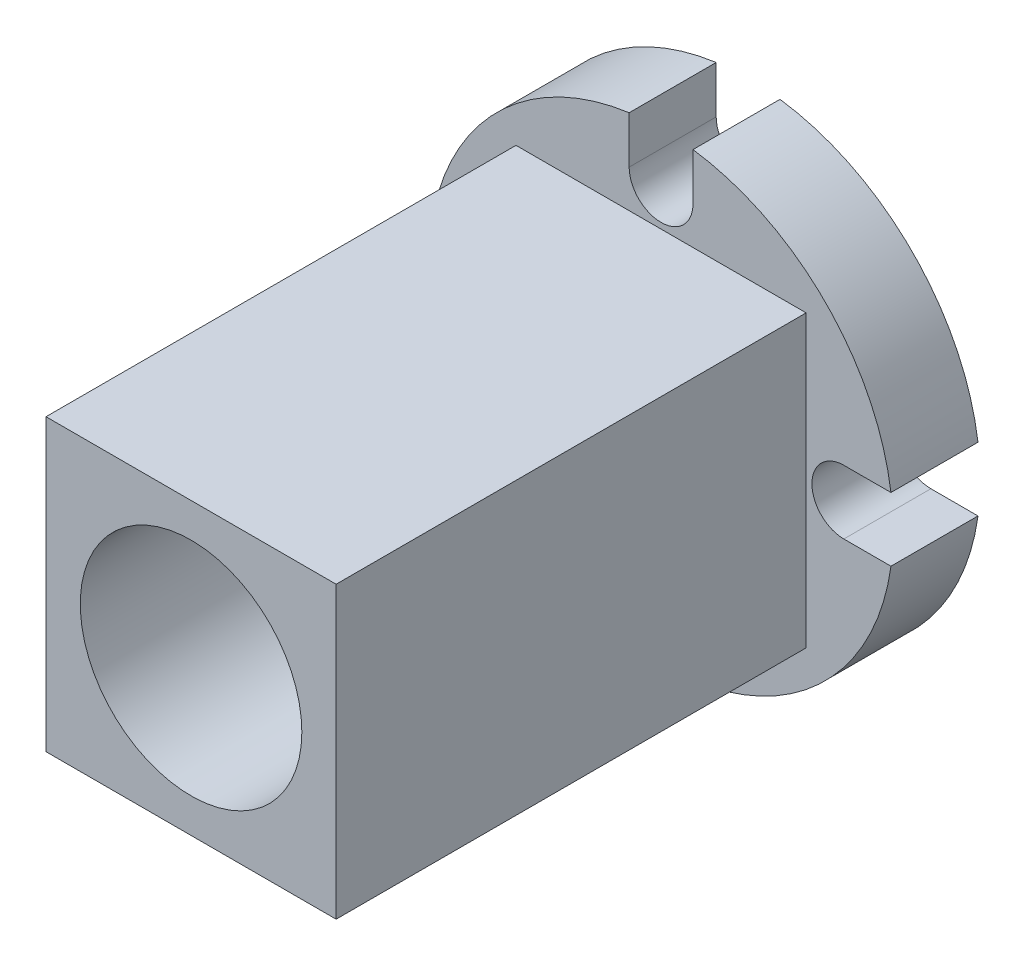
ISO-10303-21;
HEADER;
FILE_DESCRIPTION(('STEP AP214'),'2;1');
FILE_NAME('part.step','',(''),(''),'','','');
FILE_SCHEMA(('AUTOMOTIVE_DESIGN { 1 0 10303 214 1 1 1 1 }'));
ENDSEC;
DATA;
#1=APPLICATION_CONTEXT('core data for automotive mechanical design processes');
#2=APPLICATION_PROTOCOL_DEFINITION('international standard','automotive_design',2000,#1);
#3=PRODUCT_CONTEXT('',#1,'mechanical');
#4=PRODUCT('Part','Part','',(#3));
#5=PRODUCT_RELATED_PRODUCT_CATEGORY('part','',(#4));
#6=PRODUCT_DEFINITION_FORMATION('','',#4);
#7=PRODUCT_DEFINITION_CONTEXT('part definition',#1,'design');
#8=PRODUCT_DEFINITION('design','',#6,#7);
#9=PRODUCT_DEFINITION_SHAPE('','',#8);
#10=(LENGTH_UNIT() NAMED_UNIT(*) SI_UNIT(.MILLI.,.METRE.));
#11=(NAMED_UNIT(*) PLANE_ANGLE_UNIT() SI_UNIT($,.RADIAN.));
#12=(NAMED_UNIT(*) SI_UNIT($,.STERADIAN.) SOLID_ANGLE_UNIT());
#13=UNCERTAINTY_MEASURE_WITH_UNIT(LENGTH_MEASURE(1.E-05),#10,'distance_accuracy_value','');
#14=(GEOMETRIC_REPRESENTATION_CONTEXT(3) GLOBAL_UNCERTAINTY_ASSIGNED_CONTEXT((#13)) GLOBAL_UNIT_ASSIGNED_CONTEXT((#10,
#11,#12)) REPRESENTATION_CONTEXT('',''));
#15=CARTESIAN_POINT('',(0.,0.,0.));
#16=DIRECTION('',(0.,0.,1.));
#17=DIRECTION('',(1.,0.,0.));
#18=AXIS2_PLACEMENT_3D('',#15,#16,#17);
#19=CARTESIAN_POINT('',(-25.,-25.,96.));
#20=DIRECTION('',(0.,0.,1.));
#21=DIRECTION('',(1.,0.,0.));
#22=AXIS2_PLACEMENT_3D('',#19,#20,#21);
#23=PLANE('',#22);
#24=CARTESIAN_POINT('',(0.,0.,96.));
#25=DIRECTION('',(0.,0.,1.));
#26=DIRECTION('',(1.,0.,0.));
#27=AXIS2_PLACEMENT_3D('',#24,#25,#26);
#28=CIRCLE('',#27,19.0918830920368);
#29=CARTESIAN_POINT('',(19.0918830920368,0.,96.));
#30=VERTEX_POINT('',#29);
#31=EDGE_CURVE('E411',#30,#30,#28,.T.);
#32=ORIENTED_EDGE('',*,*,#31,.F.);
#33=EDGE_LOOP('',(#32));
#34=FACE_BOUND('',#33,.T.);
#35=DIRECTION('',(0.,-1.,0.));
#36=VECTOR('',#35,1.);
#37=CARTESIAN_POINT('',(-25.,25.,96.));
#38=LINE('',#37,#36);
#39=CARTESIAN_POINT('',(-25.,25.,96.));
#40=VERTEX_POINT('',#39);
#41=CARTESIAN_POINT('',(-25.,-25.,96.));
#42=VERTEX_POINT('',#41);
#43=EDGE_CURVE('E402',#40,#42,#38,.T.);
#44=ORIENTED_EDGE('',*,*,#43,.T.);
#45=DIRECTION('',(1.,0.,0.));
#46=VECTOR('',#45,1.);
#47=CARTESIAN_POINT('',(-25.,-25.,96.));
#48=LINE('',#47,#46);
#49=CARTESIAN_POINT('',(25.,-25.,96.));
#50=VERTEX_POINT('',#49);
#51=EDGE_CURVE('E417',#42,#50,#48,.T.);
#52=ORIENTED_EDGE('',*,*,#51,.T.);
#53=DIRECTION('',(0.,1.,0.));
#54=VECTOR('',#53,1.);
#55=CARTESIAN_POINT('',(25.,25.,96.));
#56=LINE('',#55,#54);
#57=CARTESIAN_POINT('',(25.,25.,96.));
#58=VERTEX_POINT('',#57);
#59=EDGE_CURVE('E414',#50,#58,#56,.T.);
#60=ORIENTED_EDGE('',*,*,#59,.T.);
#61=DIRECTION('',(-1.,0.,0.));
#62=VECTOR('',#61,1.);
#63=CARTESIAN_POINT('',(-25.,25.,96.));
#64=LINE('',#63,#62);
#65=EDGE_CURVE('E399',#58,#40,#64,.T.);
#66=ORIENTED_EDGE('',*,*,#65,.T.);
#67=EDGE_LOOP('',(#44,#52,#60,#66));
#68=FACE_BOUND('',#67,.T.);
#69=ADVANCED_FACE('F14',(#34,#68),#23,.T.);
#70=CARTESIAN_POINT('',(0.,0.,15.));
#71=DIRECTION('',(0.,0.,1.));
#72=DIRECTION('',(1.,0.,0.));
#73=AXIS2_PLACEMENT_3D('',#70,#71,#72);
#74=PLANE('',#73);
#75=CARTESIAN_POINT('',(0.,0.,15.));
#76=DIRECTION('',(0.,0.,1.));
#77=DIRECTION('',(1.,0.,0.));
#78=AXIS2_PLACEMENT_3D('',#75,#76,#77);
#79=CIRCLE('',#78,40.);
#80=CARTESIAN_POINT('',(-5.5,39.6200706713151,15.));
#81=VERTEX_POINT('',#80);
#82=CARTESIAN_POINT('',(-39.6200706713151,5.5,15.));
#83=VERTEX_POINT('',#82);
#84=EDGE_CURVE('E205',#81,#83,#79,.T.);
#85=ORIENTED_EDGE('',*,*,#84,.T.);
#86=DIRECTION('',(1.,0.,0.));
#87=VECTOR('',#86,1.);
#88=CARTESIAN_POINT('',(-39.6200706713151,5.5,15.));
#89=LINE('',#88,#87);
#90=CARTESIAN_POINT('',(-31.5,5.5,15.));
#91=VERTEX_POINT('',#90);
#92=EDGE_CURVE('E104',#83,#91,#89,.T.);
#93=ORIENTED_EDGE('',*,*,#92,.T.);
#94=CARTESIAN_POINT('',(-31.5,0.,15.));
#95=DIRECTION('',(0.,0.,-1.));
#96=DIRECTION('',(1.,0.,0.));
#97=AXIS2_PLACEMENT_3D('',#94,#95,#96);
#98=CIRCLE('',#97,5.5);
#99=CARTESIAN_POINT('',(-31.5,-5.5,15.));
#100=VERTEX_POINT('',#99);
#101=EDGE_CURVE('E360',#91,#100,#98,.T.);
#102=ORIENTED_EDGE('',*,*,#101,.T.);
#103=DIRECTION('',(-1.,0.,0.));
#104=VECTOR('',#103,1.);
#105=CARTESIAN_POINT('',(-39.6200706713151,-5.5,15.));
#106=LINE('',#105,#104);
#107=CARTESIAN_POINT('',(-39.6200706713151,-5.5,15.));
#108=VERTEX_POINT('',#107);
#109=EDGE_CURVE('E362',#100,#108,#106,.T.);
#110=ORIENTED_EDGE('',*,*,#109,.T.);
#111=CARTESIAN_POINT('',(0.,0.,15.));
#112=DIRECTION('',(0.,0.,1.));
#113=DIRECTION('',(1.,0.,0.));
#114=AXIS2_PLACEMENT_3D('',#111,#112,#113);
#115=CIRCLE('',#114,40.);
#116=CARTESIAN_POINT('',(-5.5,-39.6200706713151,15.));
#117=VERTEX_POINT('',#116);
#118=EDGE_CURVE('E364',#108,#117,#115,.T.);
#119=ORIENTED_EDGE('',*,*,#118,.T.);
#120=DIRECTION('',(0.,1.,0.));
#121=VECTOR('',#120,1.);
#122=CARTESIAN_POINT('',(-5.5,-39.6200706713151,15.));
#123=LINE('',#122,#121);
#124=CARTESIAN_POINT('',(-5.5,-31.5,15.));
#125=VERTEX_POINT('',#124);
#126=EDGE_CURVE('E370',#117,#125,#123,.T.);
#127=ORIENTED_EDGE('',*,*,#126,.T.);
#128=CARTESIAN_POINT('',(0.,-31.5,15.));
#129=DIRECTION('',(0.,0.,-1.));
#130=DIRECTION('',(1.,0.,0.));
#131=AXIS2_PLACEMENT_3D('',#128,#129,#130);
#132=CIRCLE('',#131,5.5);
#133=CARTESIAN_POINT('',(5.5,-31.5,15.));
#134=VERTEX_POINT('',#133);
#135=EDGE_CURVE('E372',#125,#134,#132,.T.);
#136=ORIENTED_EDGE('',*,*,#135,.T.);
#137=DIRECTION('',(0.,-1.,0.));
#138=VECTOR('',#137,1.);
#139=CARTESIAN_POINT('',(5.5,-39.6200706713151,15.));
#140=LINE('',#139,#138);
#141=CARTESIAN_POINT('',(5.5,-39.6200706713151,15.));
#142=VERTEX_POINT('',#141);
#143=EDGE_CURVE('E374',#134,#142,#140,.T.);
#144=ORIENTED_EDGE('',*,*,#143,.T.);
#145=CARTESIAN_POINT('',(0.,0.,15.));
#146=DIRECTION('',(0.,0.,1.));
#147=DIRECTION('',(1.,0.,0.));
#148=AXIS2_PLACEMENT_3D('',#145,#146,#147);
#149=CIRCLE('',#148,40.);
#150=CARTESIAN_POINT('',(39.6200706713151,-5.5,15.));
#151=VERTEX_POINT('',#150);
#152=EDGE_CURVE('E376',#142,#151,#149,.T.);
#153=ORIENTED_EDGE('',*,*,#152,.T.);
#154=DIRECTION('',(-1.,0.,0.));
#155=VECTOR('',#154,1.);
#156=CARTESIAN_POINT('',(39.6200706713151,-5.5,15.));
#157=LINE('',#156,#155);
#158=CARTESIAN_POINT('',(31.5,-5.5,15.));
#159=VERTEX_POINT('',#158);
#160=EDGE_CURVE('E378',#151,#159,#157,.T.);
#161=ORIENTED_EDGE('',*,*,#160,.T.);
#162=CARTESIAN_POINT('',(31.5,0.,15.));
#163=DIRECTION('',(0.,0.,-1.));
#164=DIRECTION('',(1.,0.,0.));
#165=AXIS2_PLACEMENT_3D('',#162,#163,#164);
#166=CIRCLE('',#165,5.5);
#167=CARTESIAN_POINT('',(31.5,5.5,15.));
#168=VERTEX_POINT('',#167);
#169=EDGE_CURVE('E380',#159,#168,#166,.T.);
#170=ORIENTED_EDGE('',*,*,#169,.T.);
#171=DIRECTION('',(1.,0.,0.));
#172=VECTOR('',#171,1.);
#173=CARTESIAN_POINT('',(39.6200706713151,5.5,15.));
#174=LINE('',#173,#172);
#175=CARTESIAN_POINT('',(39.6200706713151,5.5,15.));
#176=VERTEX_POINT('',#175);
#177=EDGE_CURVE('E382',#168,#176,#174,.T.);
#178=ORIENTED_EDGE('',*,*,#177,.T.);
#179=CARTESIAN_POINT('',(0.,0.,15.));
#180=DIRECTION('',(0.,0.,1.));
#181=DIRECTION('',(1.,0.,0.));
#182=AXIS2_PLACEMENT_3D('',#179,#180,#181);
#183=CIRCLE('',#182,40.);
#184=CARTESIAN_POINT('',(5.5,39.6200706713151,15.));
#185=VERTEX_POINT('',#184);
#186=EDGE_CURVE('E152',#176,#185,#183,.T.);
#187=ORIENTED_EDGE('',*,*,#186,.T.);
#188=DIRECTION('',(0.,-1.,0.));
#189=VECTOR('',#188,1.);
#190=CARTESIAN_POINT('',(5.5,39.6200706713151,15.));
#191=LINE('',#190,#189);
#192=CARTESIAN_POINT('',(5.5,31.5,15.));
#193=VERTEX_POINT('',#192);
#194=EDGE_CURVE('E144',#185,#193,#191,.T.);
#195=ORIENTED_EDGE('',*,*,#194,.T.);
#196=CARTESIAN_POINT('',(0.,31.5,15.));
#197=DIRECTION('',(0.,0.,-1.));
#198=DIRECTION('',(1.,0.,0.));
#199=AXIS2_PLACEMENT_3D('',#196,#197,#198);
#200=CIRCLE('',#199,5.5);
#201=CARTESIAN_POINT('',(-5.5,31.5,15.));
#202=VERTEX_POINT('',#201);
#203=EDGE_CURVE('E149',#193,#202,#200,.T.);
#204=ORIENTED_EDGE('',*,*,#203,.T.);
#205=DIRECTION('',(0.,1.,0.));
#206=VECTOR('',#205,1.);
#207=CARTESIAN_POINT('',(-5.5,39.6200706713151,15.));
#208=LINE('',#207,#206);
#209=EDGE_CURVE('E38',#202,#81,#208,.T.);
#210=ORIENTED_EDGE('',*,*,#209,.T.);
#211=EDGE_LOOP('',(#85,#93,#102,#110,#119,#127,#136,#144,#153,#161,#170,#178,#187,#195,#204,#210));
#212=FACE_BOUND('',#211,.T.);
#213=DIRECTION('',(1.,0.,0.));
#214=VECTOR('',#213,1.);
#215=CARTESIAN_POINT('',(-25.,-25.,15.));
#216=LINE('',#215,#214);
#217=CARTESIAN_POINT('',(-25.,-25.,15.));
#218=VERTEX_POINT('',#217);
#219=CARTESIAN_POINT('',(25.,-25.,15.));
#220=VERTEX_POINT('',#219);
#221=EDGE_CURVE('E405',#218,#220,#216,.T.);
#222=ORIENTED_EDGE('',*,*,#221,.F.);
#223=DIRECTION('',(0.,-1.,0.));
#224=VECTOR('',#223,1.);
#225=CARTESIAN_POINT('',(-25.,25.,15.));
#226=LINE('',#225,#224);
#227=CARTESIAN_POINT('',(-25.,25.,15.));
#228=VERTEX_POINT('',#227);
#229=EDGE_CURVE('E408',#228,#218,#226,.T.);
#230=ORIENTED_EDGE('',*,*,#229,.F.);
#231=DIRECTION('',(-1.,0.,0.));
#232=VECTOR('',#231,1.);
#233=CARTESIAN_POINT('',(-25.,25.,15.));
#234=LINE('',#233,#232);
#235=CARTESIAN_POINT('',(25.,25.,15.));
#236=VERTEX_POINT('',#235);
#237=EDGE_CURVE('E400',#236,#228,#234,.T.);
#238=ORIENTED_EDGE('',*,*,#237,.F.);
#239=DIRECTION('',(0.,1.,0.));
#240=VECTOR('',#239,1.);
#241=CARTESIAN_POINT('',(25.,25.,15.));
#242=LINE('',#241,#240);
#243=EDGE_CURVE('E403',#220,#236,#242,.T.);
#244=ORIENTED_EDGE('',*,*,#243,.F.);
#245=EDGE_LOOP('',(#222,#230,#238,#244));
#246=FACE_BOUND('',#245,.T.);
#247=ADVANCED_FACE('F146',(#212,#246),#74,.T.);
#248=CARTESIAN_POINT('',(0.,0.,15.));
#249=DIRECTION('',(0.,0.,-1.));
#250=DIRECTION('',(-1.,0.,0.));
#251=AXIS2_PLACEMENT_3D('',#248,#249,#250);
#252=CYLINDRICAL_SURFACE('',#251,40.);
#253=CARTESIAN_POINT('',(0.,0.,0.));
#254=DIRECTION('',(0.,0.,1.));
#255=DIRECTION('',(1.,0.,0.));
#256=AXIS2_PLACEMENT_3D('',#253,#254,#255);
#257=CIRCLE('',#256,40.);
#258=CARTESIAN_POINT('',(-5.5,39.6200706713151,0.));
#259=VERTEX_POINT('',#258);
#260=CARTESIAN_POINT('',(-39.6200706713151,5.5,0.));
#261=VERTEX_POINT('',#260);
#262=EDGE_CURVE('E173',#259,#261,#257,.T.);
#263=ORIENTED_EDGE('',*,*,#262,.T.);
#264=DIRECTION('',(0.,0.,-1.));
#265=VECTOR('',#264,1.);
#266=CARTESIAN_POINT('',(-39.6200706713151,5.5,15.));
#267=LINE('',#266,#265);
#268=EDGE_CURVE('E242',#83,#261,#267,.T.);
#269=ORIENTED_EDGE('',*,*,#268,.F.);
#270=ORIENTED_EDGE('',*,*,#84,.F.);
#271=DIRECTION('',(0.,0.,-1.));
#272=VECTOR('',#271,1.);
#273=CARTESIAN_POINT('',(-5.5,39.6200706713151,15.));
#274=LINE('',#273,#272);
#275=EDGE_CURVE('E169',#81,#259,#274,.T.);
#276=ORIENTED_EDGE('',*,*,#275,.T.);
#277=EDGE_LOOP('',(#263,#269,#270,#276));
#278=FACE_BOUND('',#277,.T.);
#279=ADVANCED_FACE('F267',(#278),#252,.T.);
#280=CARTESIAN_POINT('',(-39.6200706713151,5.5,15.));
#281=DIRECTION('',(0.,1.,0.));
#282=DIRECTION('',(0.,0.,1.));
#283=AXIS2_PLACEMENT_3D('',#280,#281,#282);
#284=PLANE('',#283);
#285=DIRECTION('',(1.,0.,0.));
#286=VECTOR('',#285,1.);
#287=CARTESIAN_POINT('',(-39.6200706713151,5.5,0.));
#288=LINE('',#287,#286);
#289=CARTESIAN_POINT('',(-31.5,5.5,0.));
#290=VERTEX_POINT('',#289);
#291=EDGE_CURVE('E176',#261,#290,#288,.T.);
#292=ORIENTED_EDGE('',*,*,#291,.T.);
#293=DIRECTION('',(0.,0.,-1.));
#294=VECTOR('',#293,1.);
#295=CARTESIAN_POINT('',(-31.5,5.5,15.));
#296=LINE('',#295,#294);
#297=EDGE_CURVE('E239',#91,#290,#296,.T.);
#298=ORIENTED_EDGE('',*,*,#297,.F.);
#299=ORIENTED_EDGE('',*,*,#92,.F.);
#300=ORIENTED_EDGE('',*,*,#268,.T.);
#301=EDGE_LOOP('',(#292,#298,#299,#300));
#302=FACE_BOUND('',#301,.T.);
#303=ADVANCED_FACE('F344',(#302),#284,.F.);
#304=CARTESIAN_POINT('',(-31.5,0.,15.));
#305=DIRECTION('',(0.,0.,-1.));
#306=DIRECTION('',(-1.,0.,0.));
#307=AXIS2_PLACEMENT_3D('',#304,#305,#306);
#308=CYLINDRICAL_SURFACE('',#307,5.5);
#309=CARTESIAN_POINT('',(-31.5,0.,0.));
#310=DIRECTION('',(0.,0.,-1.));
#311=DIRECTION('',(1.,0.,0.));
#312=AXIS2_PLACEMENT_3D('',#309,#310,#311);
#313=CIRCLE('',#312,5.5);
#314=CARTESIAN_POINT('',(-31.5,-5.5,0.));
#315=VERTEX_POINT('',#314);
#316=EDGE_CURVE('E179',#290,#315,#313,.T.);
#317=ORIENTED_EDGE('',*,*,#316,.T.);
#318=DIRECTION('',(0.,0.,-1.));
#319=VECTOR('',#318,1.);
#320=CARTESIAN_POINT('',(-31.5,-5.5,15.));
#321=LINE('',#320,#319);
#322=EDGE_CURVE('E236',#100,#315,#321,.T.);
#323=ORIENTED_EDGE('',*,*,#322,.F.);
#324=ORIENTED_EDGE('',*,*,#101,.F.);
#325=ORIENTED_EDGE('',*,*,#297,.T.);
#326=EDGE_LOOP('',(#317,#323,#324,#325));
#327=FACE_BOUND('',#326,.T.);
#328=ADVANCED_FACE('F340',(#327),#308,.F.);
#329=CARTESIAN_POINT('',(-39.6200706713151,-5.5,15.));
#330=DIRECTION('',(0.,-1.,0.));
#331=DIRECTION('',(0.,0.,-1.));
#332=AXIS2_PLACEMENT_3D('',#329,#330,#331);
#333=PLANE('',#332);
#334=DIRECTION('',(-1.,0.,0.));
#335=VECTOR('',#334,1.);
#336=CARTESIAN_POINT('',(-39.6200706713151,-5.5,0.));
#337=LINE('',#336,#335);
#338=CARTESIAN_POINT('',(-39.6200706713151,-5.5,0.));
#339=VERTEX_POINT('',#338);
#340=EDGE_CURVE('E181',#315,#339,#337,.T.);
#341=ORIENTED_EDGE('',*,*,#340,.T.);
#342=DIRECTION('',(0.,0.,-1.));
#343=VECTOR('',#342,1.);
#344=CARTESIAN_POINT('',(-39.6200706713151,-5.5,15.));
#345=LINE('',#344,#343);
#346=EDGE_CURVE('E233',#108,#339,#345,.T.);
#347=ORIENTED_EDGE('',*,*,#346,.F.);
#348=ORIENTED_EDGE('',*,*,#109,.F.);
#349=ORIENTED_EDGE('',*,*,#322,.T.);
#350=EDGE_LOOP('',(#341,#347,#348,#349));
#351=FACE_BOUND('',#350,.T.);
#352=ADVANCED_FACE('F336',(#351),#333,.F.);
#353=CARTESIAN_POINT('',(0.,0.,15.));
#354=DIRECTION('',(0.,0.,-1.));
#355=DIRECTION('',(-1.,0.,0.));
#356=AXIS2_PLACEMENT_3D('',#353,#354,#355);
#357=CYLINDRICAL_SURFACE('',#356,40.);
#358=CARTESIAN_POINT('',(0.,0.,0.));
#359=DIRECTION('',(0.,0.,1.));
#360=DIRECTION('',(1.,0.,0.));
#361=AXIS2_PLACEMENT_3D('',#358,#359,#360);
#362=CIRCLE('',#361,40.);
#363=CARTESIAN_POINT('',(-5.5,-39.6200706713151,0.));
#364=VERTEX_POINT('',#363);
#365=EDGE_CURVE('E183',#339,#364,#362,.T.);
#366=ORIENTED_EDGE('',*,*,#365,.T.);
#367=DIRECTION('',(0.,0.,-1.));
#368=VECTOR('',#367,1.);
#369=CARTESIAN_POINT('',(-5.5,-39.6200706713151,15.));
#370=LINE('',#369,#368);
#371=EDGE_CURVE('E230',#117,#364,#370,.T.);
#372=ORIENTED_EDGE('',*,*,#371,.F.);
#373=ORIENTED_EDGE('',*,*,#118,.F.);
#374=ORIENTED_EDGE('',*,*,#346,.T.);
#375=EDGE_LOOP('',(#366,#372,#373,#374));
#376=FACE_BOUND('',#375,.T.);
#377=ADVANCED_FACE('F332',(#376),#357,.T.);
#378=CARTESIAN_POINT('',(-5.5,-39.6200706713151,15.));
#379=DIRECTION('',(-1.,0.,0.));
#380=DIRECTION('',(0.,0.,1.));
#381=AXIS2_PLACEMENT_3D('',#378,#379,#380);
#382=PLANE('',#381);
#383=DIRECTION('',(0.,1.,0.));
#384=VECTOR('',#383,1.);
#385=CARTESIAN_POINT('',(-5.5,-39.6200706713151,0.));
#386=LINE('',#385,#384);
#387=CARTESIAN_POINT('',(-5.5,-31.5,0.));
#388=VERTEX_POINT('',#387);
#389=EDGE_CURVE('E185',#364,#388,#386,.T.);
#390=ORIENTED_EDGE('',*,*,#389,.T.);
#391=DIRECTION('',(0.,0.,-1.));
#392=VECTOR('',#391,1.);
#393=CARTESIAN_POINT('',(-5.5,-31.5,15.));
#394=LINE('',#393,#392);
#395=EDGE_CURVE('E227',#125,#388,#394,.T.);
#396=ORIENTED_EDGE('',*,*,#395,.F.);
#397=ORIENTED_EDGE('',*,*,#126,.F.);
#398=ORIENTED_EDGE('',*,*,#371,.T.);
#399=EDGE_LOOP('',(#390,#396,#397,#398));
#400=FACE_BOUND('',#399,.T.);
#401=ADVANCED_FACE('F328',(#400),#382,.F.);
#402=CARTESIAN_POINT('',(0.,-31.5,15.));
#403=DIRECTION('',(0.,0.,-1.));
#404=DIRECTION('',(-1.,0.,0.));
#405=AXIS2_PLACEMENT_3D('',#402,#403,#404);
#406=CYLINDRICAL_SURFACE('',#405,5.5);
#407=CARTESIAN_POINT('',(0.,-31.5,0.));
#408=DIRECTION('',(0.,0.,-1.));
#409=DIRECTION('',(1.,0.,0.));
#410=AXIS2_PLACEMENT_3D('',#407,#408,#409);
#411=CIRCLE('',#410,5.5);
#412=CARTESIAN_POINT('',(5.5,-31.5,0.));
#413=VERTEX_POINT('',#412);
#414=EDGE_CURVE('E187',#388,#413,#411,.T.);
#415=ORIENTED_EDGE('',*,*,#414,.T.);
#416=DIRECTION('',(0.,0.,-1.));
#417=VECTOR('',#416,1.);
#418=CARTESIAN_POINT('',(5.5,-31.5,15.));
#419=LINE('',#418,#417);
#420=EDGE_CURVE('E224',#134,#413,#419,.T.);
#421=ORIENTED_EDGE('',*,*,#420,.F.);
#422=ORIENTED_EDGE('',*,*,#135,.F.);
#423=ORIENTED_EDGE('',*,*,#395,.T.);
#424=EDGE_LOOP('',(#415,#421,#422,#423));
#425=FACE_BOUND('',#424,.T.);
#426=ADVANCED_FACE('F324',(#425),#406,.F.);
#427=CARTESIAN_POINT('',(5.5,-39.6200706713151,15.));
#428=DIRECTION('',(1.,0.,0.));
#429=DIRECTION('',(0.,0.,-1.));
#430=AXIS2_PLACEMENT_3D('',#427,#428,#429);
#431=PLANE('',#430);
#432=DIRECTION('',(0.,-1.,0.));
#433=VECTOR('',#432,1.);
#434=CARTESIAN_POINT('',(5.5,-39.6200706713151,0.));
#435=LINE('',#434,#433);
#436=CARTESIAN_POINT('',(5.5,-39.6200706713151,0.));
#437=VERTEX_POINT('',#436);
#438=EDGE_CURVE('E189',#413,#437,#435,.T.);
#439=ORIENTED_EDGE('',*,*,#438,.T.);
#440=DIRECTION('',(0.,0.,-1.));
#441=VECTOR('',#440,1.);
#442=CARTESIAN_POINT('',(5.5,-39.6200706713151,15.));
#443=LINE('',#442,#441);
#444=EDGE_CURVE('E221',#142,#437,#443,.T.);
#445=ORIENTED_EDGE('',*,*,#444,.F.);
#446=ORIENTED_EDGE('',*,*,#143,.F.);
#447=ORIENTED_EDGE('',*,*,#420,.T.);
#448=EDGE_LOOP('',(#439,#445,#446,#447));
#449=FACE_BOUND('',#448,.T.);
#450=ADVANCED_FACE('F320',(#449),#431,.F.);
#451=CARTESIAN_POINT('',(0.,0.,15.));
#452=DIRECTION('',(0.,0.,-1.));
#453=DIRECTION('',(-1.,0.,0.));
#454=AXIS2_PLACEMENT_3D('',#451,#452,#453);
#455=CYLINDRICAL_SURFACE('',#454,40.);
#456=CARTESIAN_POINT('',(0.,0.,0.));
#457=DIRECTION('',(0.,0.,1.));
#458=DIRECTION('',(1.,0.,0.));
#459=AXIS2_PLACEMENT_3D('',#456,#457,#458);
#460=CIRCLE('',#459,40.);
#461=CARTESIAN_POINT('',(39.6200706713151,-5.5,0.));
#462=VERTEX_POINT('',#461);
#463=EDGE_CURVE('E191',#437,#462,#460,.T.);
#464=ORIENTED_EDGE('',*,*,#463,.T.);
#465=DIRECTION('',(0.,0.,-1.));
#466=VECTOR('',#465,1.);
#467=CARTESIAN_POINT('',(39.6200706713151,-5.5,15.));
#468=LINE('',#467,#466);
#469=EDGE_CURVE('E218',#151,#462,#468,.T.);
#470=ORIENTED_EDGE('',*,*,#469,.F.);
#471=ORIENTED_EDGE('',*,*,#152,.F.);
#472=ORIENTED_EDGE('',*,*,#444,.T.);
#473=EDGE_LOOP('',(#464,#470,#471,#472));
#474=FACE_BOUND('',#473,.T.);
#475=ADVANCED_FACE('F316',(#474),#455,.T.);
#476=CARTESIAN_POINT('',(39.6200706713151,-5.5,15.));
#477=DIRECTION('',(0.,-1.,0.));
#478=DIRECTION('',(0.,0.,-1.));
#479=AXIS2_PLACEMENT_3D('',#476,#477,#478);
#480=PLANE('',#479);
#481=DIRECTION('',(-1.,0.,0.));
#482=VECTOR('',#481,1.);
#483=CARTESIAN_POINT('',(39.6200706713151,-5.5,0.));
#484=LINE('',#483,#482);
#485=CARTESIAN_POINT('',(31.5,-5.5,0.));
#486=VERTEX_POINT('',#485);
#487=EDGE_CURVE('E193',#462,#486,#484,.T.);
#488=ORIENTED_EDGE('',*,*,#487,.T.);
#489=DIRECTION('',(0.,0.,-1.));
#490=VECTOR('',#489,1.);
#491=CARTESIAN_POINT('',(31.5,-5.5,15.));
#492=LINE('',#491,#490);
#493=EDGE_CURVE('E215',#159,#486,#492,.T.);
#494=ORIENTED_EDGE('',*,*,#493,.F.);
#495=ORIENTED_EDGE('',*,*,#160,.F.);
#496=ORIENTED_EDGE('',*,*,#469,.T.);
#497=EDGE_LOOP('',(#488,#494,#495,#496));
#498=FACE_BOUND('',#497,.T.);
#499=ADVANCED_FACE('F312',(#498),#480,.F.);
#500=CARTESIAN_POINT('',(31.5,0.,15.));
#501=DIRECTION('',(0.,0.,-1.));
#502=DIRECTION('',(-1.,0.,0.));
#503=AXIS2_PLACEMENT_3D('',#500,#501,#502);
#504=CYLINDRICAL_SURFACE('',#503,5.5);
#505=CARTESIAN_POINT('',(31.5,0.,0.));
#506=DIRECTION('',(0.,0.,-1.));
#507=DIRECTION('',(1.,0.,0.));
#508=AXIS2_PLACEMENT_3D('',#505,#506,#507);
#509=CIRCLE('',#508,5.5);
#510=CARTESIAN_POINT('',(31.5,5.5,0.));
#511=VERTEX_POINT('',#510);
#512=EDGE_CURVE('E195',#486,#511,#509,.T.);
#513=ORIENTED_EDGE('',*,*,#512,.T.);
#514=DIRECTION('',(0.,0.,-1.));
#515=VECTOR('',#514,1.);
#516=CARTESIAN_POINT('',(31.5,5.5,15.));
#517=LINE('',#516,#515);
#518=EDGE_CURVE('E212',#168,#511,#517,.T.);
#519=ORIENTED_EDGE('',*,*,#518,.F.);
#520=ORIENTED_EDGE('',*,*,#169,.F.);
#521=ORIENTED_EDGE('',*,*,#493,.T.);
#522=EDGE_LOOP('',(#513,#519,#520,#521));
#523=FACE_BOUND('',#522,.T.);
#524=ADVANCED_FACE('F308',(#523),#504,.F.);
#525=CARTESIAN_POINT('',(39.6200706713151,5.5,15.));
#526=DIRECTION('',(0.,1.,0.));
#527=DIRECTION('',(0.,0.,1.));
#528=AXIS2_PLACEMENT_3D('',#525,#526,#527);
#529=PLANE('',#528);
#530=DIRECTION('',(1.,0.,0.));
#531=VECTOR('',#530,1.);
#532=CARTESIAN_POINT('',(39.6200706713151,5.5,0.));
#533=LINE('',#532,#531);
#534=CARTESIAN_POINT('',(39.6200706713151,5.5,0.));
#535=VERTEX_POINT('',#534);
#536=EDGE_CURVE('E197',#511,#535,#533,.T.);
#537=ORIENTED_EDGE('',*,*,#536,.T.);
#538=DIRECTION('',(0.,0.,-1.));
#539=VECTOR('',#538,1.);
#540=CARTESIAN_POINT('',(39.6200706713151,5.5,15.));
#541=LINE('',#540,#539);
#542=EDGE_CURVE('E209',#176,#535,#541,.T.);
#543=ORIENTED_EDGE('',*,*,#542,.F.);
#544=ORIENTED_EDGE('',*,*,#177,.F.);
#545=ORIENTED_EDGE('',*,*,#518,.T.);
#546=EDGE_LOOP('',(#537,#543,#544,#545));
#547=FACE_BOUND('',#546,.T.);
#548=ADVANCED_FACE('F304',(#547),#529,.F.);
#549=CARTESIAN_POINT('',(0.,0.,15.));
#550=DIRECTION('',(0.,0.,-1.));
#551=DIRECTION('',(-1.,0.,0.));
#552=AXIS2_PLACEMENT_3D('',#549,#550,#551);
#553=CYLINDRICAL_SURFACE('',#552,40.);
#554=CARTESIAN_POINT('',(0.,0.,0.));
#555=DIRECTION('',(0.,0.,1.));
#556=DIRECTION('',(1.,0.,0.));
#557=AXIS2_PLACEMENT_3D('',#554,#555,#556);
#558=CIRCLE('',#557,40.);
#559=CARTESIAN_POINT('',(5.5,39.6200706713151,0.));
#560=VERTEX_POINT('',#559);
#561=EDGE_CURVE('E199',#535,#560,#558,.T.);
#562=ORIENTED_EDGE('',*,*,#561,.T.);
#563=DIRECTION('',(0.,0.,-1.));
#564=VECTOR('',#563,1.);
#565=CARTESIAN_POINT('',(5.5,39.6200706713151,15.));
#566=LINE('',#565,#564);
#567=EDGE_CURVE('E164',#185,#560,#566,.T.);
#568=ORIENTED_EDGE('',*,*,#567,.F.);
#569=ORIENTED_EDGE('',*,*,#186,.F.);
#570=ORIENTED_EDGE('',*,*,#542,.T.);
#571=EDGE_LOOP('',(#562,#568,#569,#570));
#572=FACE_BOUND('',#571,.T.);
#573=ADVANCED_FACE('F301',(#572),#553,.T.);
#574=CARTESIAN_POINT('',(5.5,39.6200706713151,15.));
#575=DIRECTION('',(1.,0.,0.));
#576=DIRECTION('',(0.,0.,-1.));
#577=AXIS2_PLACEMENT_3D('',#574,#575,#576);
#578=PLANE('',#577);
#579=DIRECTION('',(0.,-1.,0.));
#580=VECTOR('',#579,1.);
#581=CARTESIAN_POINT('',(5.5,39.6200706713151,0.));
#582=LINE('',#581,#580);
#583=CARTESIAN_POINT('',(5.5,31.5,0.));
#584=VERTEX_POINT('',#583);
#585=EDGE_CURVE('E161',#560,#584,#582,.T.);
#586=ORIENTED_EDGE('',*,*,#585,.T.);
#587=DIRECTION('',(0.,0.,-1.));
#588=VECTOR('',#587,1.);
#589=CARTESIAN_POINT('',(5.5,31.5,15.));
#590=LINE('',#589,#588);
#591=EDGE_CURVE('E158',#193,#584,#590,.T.);
#592=ORIENTED_EDGE('',*,*,#591,.F.);
#593=ORIENTED_EDGE('',*,*,#194,.F.);
#594=ORIENTED_EDGE('',*,*,#567,.T.);
#595=EDGE_LOOP('',(#586,#592,#593,#594));
#596=FACE_BOUND('',#595,.T.);
#597=ADVANCED_FACE('F159',(#596),#578,.F.);
#598=CARTESIAN_POINT('',(0.,31.5,15.));
#599=DIRECTION('',(0.,0.,-1.));
#600=DIRECTION('',(-1.,0.,0.));
#601=AXIS2_PLACEMENT_3D('',#598,#599,#600);
#602=CYLINDRICAL_SURFACE('',#601,5.5);
#603=CARTESIAN_POINT('',(0.,31.5,0.));
#604=DIRECTION('',(0.,0.,-1.));
#605=DIRECTION('',(1.,0.,0.));
#606=AXIS2_PLACEMENT_3D('',#603,#604,#605);
#607=CIRCLE('',#606,5.5);
#608=CARTESIAN_POINT('',(-5.5,31.5,0.));
#609=VERTEX_POINT('',#608);
#610=EDGE_CURVE('E202',#584,#609,#607,.T.);
#611=ORIENTED_EDGE('',*,*,#610,.T.);
#612=DIRECTION('',(0.,0.,-1.));
#613=VECTOR('',#612,1.);
#614=CARTESIAN_POINT('',(-5.5,31.5,15.));
#615=LINE('',#614,#613);
#616=EDGE_CURVE('E165',#202,#609,#615,.T.);
#617=ORIENTED_EDGE('',*,*,#616,.F.);
#618=ORIENTED_EDGE('',*,*,#203,.F.);
#619=ORIENTED_EDGE('',*,*,#591,.T.);
#620=EDGE_LOOP('',(#611,#617,#618,#619));
#621=FACE_BOUND('',#620,.T.);
#622=ADVANCED_FACE('F167',(#621),#602,.F.);
#623=CARTESIAN_POINT('',(-5.5,39.6200706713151,15.));
#624=DIRECTION('',(-1.,0.,0.));
#625=DIRECTION('',(0.,0.,1.));
#626=AXIS2_PLACEMENT_3D('',#623,#624,#625);
#627=PLANE('',#626);
#628=DIRECTION('',(0.,1.,0.));
#629=VECTOR('',#628,1.);
#630=CARTESIAN_POINT('',(-5.5,39.6200706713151,0.));
#631=LINE('',#630,#629);
#632=EDGE_CURVE('E95',#609,#259,#631,.T.);
#633=ORIENTED_EDGE('',*,*,#632,.T.);
#634=ORIENTED_EDGE('',*,*,#275,.F.);
#635=ORIENTED_EDGE('',*,*,#209,.F.);
#636=ORIENTED_EDGE('',*,*,#616,.T.);
#637=EDGE_LOOP('',(#633,#634,#635,#636));
#638=FACE_BOUND('',#637,.T.);
#639=ADVANCED_FACE('F293',(#638),#627,.F.);
#640=CARTESIAN_POINT('',(0.,0.,0.));
#641=DIRECTION('',(0.,0.,1.));
#642=DIRECTION('',(1.,0.,0.));
#643=AXIS2_PLACEMENT_3D('',#640,#641,#642);
#644=PLANE('',#643);
#645=CARTESIAN_POINT('',(0.,0.,0.));
#646=DIRECTION('',(0.,0.,1.));
#647=DIRECTION('',(1.,0.,0.));
#648=AXIS2_PLACEMENT_3D('',#645,#646,#647);
#649=CIRCLE('',#648,7.);
#650=CARTESIAN_POINT('',(7.,0.,0.));
#651=VERTEX_POINT('',#650);
#652=EDGE_CURVE('E9',#651,#651,#649,.T.);
#653=ORIENTED_EDGE('',*,*,#652,.T.);
#654=EDGE_LOOP('',(#653));
#655=FACE_BOUND('',#654,.T.);
#656=ORIENTED_EDGE('',*,*,#262,.F.);
#657=ORIENTED_EDGE('',*,*,#632,.F.);
#658=ORIENTED_EDGE('',*,*,#610,.F.);
#659=ORIENTED_EDGE('',*,*,#585,.F.);
#660=ORIENTED_EDGE('',*,*,#561,.F.);
#661=ORIENTED_EDGE('',*,*,#536,.F.);
#662=ORIENTED_EDGE('',*,*,#512,.F.);
#663=ORIENTED_EDGE('',*,*,#487,.F.);
#664=ORIENTED_EDGE('',*,*,#463,.F.);
#665=ORIENTED_EDGE('',*,*,#438,.F.);
#666=ORIENTED_EDGE('',*,*,#414,.F.);
#667=ORIENTED_EDGE('',*,*,#389,.F.);
#668=ORIENTED_EDGE('',*,*,#365,.F.);
#669=ORIENTED_EDGE('',*,*,#340,.F.);
#670=ORIENTED_EDGE('',*,*,#316,.F.);
#671=ORIENTED_EDGE('',*,*,#291,.F.);
#672=EDGE_LOOP('',(#656,#657,#658,#659,#660,#661,#662,#663,#664,#665,#666,#667,#668,#669,#670,#671));
#673=FACE_BOUND('',#672,.T.);
#674=ADVANCED_FACE('F288',(#655,#673),#644,.F.);
#675=CARTESIAN_POINT('',(-25.,25.,96.));
#676=DIRECTION('',(1.,0.,0.));
#677=DIRECTION('',(0.,1.,0.));
#678=AXIS2_PLACEMENT_3D('',#675,#676,#677);
#679=PLANE('',#678);
#680=ORIENTED_EDGE('',*,*,#229,.T.);
#681=DIRECTION('',(0.,0.,-1.));
#682=VECTOR('',#681,1.);
#683=CARTESIAN_POINT('',(-25.,-25.,96.));
#684=LINE('',#683,#682);
#685=EDGE_CURVE('E177',#42,#218,#684,.T.);
#686=ORIENTED_EDGE('',*,*,#685,.F.);
#687=ORIENTED_EDGE('',*,*,#43,.F.);
#688=DIRECTION('',(0.,0.,-1.));
#689=VECTOR('',#688,1.);
#690=CARTESIAN_POINT('',(-25.,25.,96.));
#691=LINE('',#690,#689);
#692=EDGE_CURVE('E396',#40,#228,#691,.T.);
#693=ORIENTED_EDGE('',*,*,#692,.T.);
#694=EDGE_LOOP('',(#680,#686,#687,#693));
#695=FACE_BOUND('',#694,.T.);
#696=ADVANCED_FACE('F285',(#695),#679,.F.);
#697=CARTESIAN_POINT('',(-25.,-25.,96.));
#698=DIRECTION('',(0.,1.,0.));
#699=DIRECTION('',(0.,0.,1.));
#700=AXIS2_PLACEMENT_3D('',#697,#698,#699);
#701=PLANE('',#700);
#702=ORIENTED_EDGE('',*,*,#221,.T.);
#703=DIRECTION('',(0.,0.,-1.));
#704=VECTOR('',#703,1.);
#705=CARTESIAN_POINT('',(25.,-25.,96.));
#706=LINE('',#705,#704);
#707=EDGE_CURVE('E392',#50,#220,#706,.T.);
#708=ORIENTED_EDGE('',*,*,#707,.F.);
#709=ORIENTED_EDGE('',*,*,#51,.F.);
#710=ORIENTED_EDGE('',*,*,#685,.T.);
#711=EDGE_LOOP('',(#702,#708,#709,#710));
#712=FACE_BOUND('',#711,.T.);
#713=ADVANCED_FACE('F281',(#712),#701,.F.);
#714=CARTESIAN_POINT('',(25.,25.,96.));
#715=DIRECTION('',(-1.,0.,0.));
#716=DIRECTION('',(0.,-1.,0.));
#717=AXIS2_PLACEMENT_3D('',#714,#715,#716);
#718=PLANE('',#717);
#719=ORIENTED_EDGE('',*,*,#243,.T.);
#720=DIRECTION('',(0.,0.,-1.));
#721=VECTOR('',#720,1.);
#722=CARTESIAN_POINT('',(25.,25.,96.));
#723=LINE('',#722,#721);
#724=EDGE_CURVE('E29',#58,#236,#723,.T.);
#725=ORIENTED_EDGE('',*,*,#724,.F.);
#726=ORIENTED_EDGE('',*,*,#59,.F.);
#727=ORIENTED_EDGE('',*,*,#707,.T.);
#728=EDGE_LOOP('',(#719,#725,#726,#727));
#729=FACE_BOUND('',#728,.T.);
#730=ADVANCED_FACE('F278',(#729),#718,.F.);
#731=CARTESIAN_POINT('',(-25.,25.,96.));
#732=DIRECTION('',(0.,-1.,0.));
#733=DIRECTION('',(0.,0.,-1.));
#734=AXIS2_PLACEMENT_3D('',#731,#732,#733);
#735=PLANE('',#734);
#736=ORIENTED_EDGE('',*,*,#237,.T.);
#737=ORIENTED_EDGE('',*,*,#692,.F.);
#738=ORIENTED_EDGE('',*,*,#65,.F.);
#739=ORIENTED_EDGE('',*,*,#724,.T.);
#740=EDGE_LOOP('',(#736,#737,#738,#739));
#741=FACE_BOUND('',#740,.T.);
#742=ADVANCED_FACE('F275',(#741),#735,.F.);
#743=CARTESIAN_POINT('',(0.,0.,66.));
#744=DIRECTION('',(0.,0.,1.));
#745=DIRECTION('',(1.,0.,0.));
#746=AXIS2_PLACEMENT_3D('',#743,#744,#745);
#747=CYLINDRICAL_SURFACE('',#746,19.0918830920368);
#748=ORIENTED_EDGE('',*,*,#31,.T.);
#749=EDGE_LOOP('',(#748));
#750=FACE_BOUND('',#749,.T.);
#751=CARTESIAN_POINT('',(0.,0.,66.));
#752=DIRECTION('',(0.,0.,1.));
#753=DIRECTION('',(1.,0.,0.));
#754=AXIS2_PLACEMENT_3D('',#751,#752,#753);
#755=CIRCLE('',#754,19.0918830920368);
#756=CARTESIAN_POINT('',(19.0918830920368,0.,66.));
#757=VERTEX_POINT('',#756);
#758=EDGE_CURVE('E424',#757,#757,#755,.T.);
#759=ORIENTED_EDGE('',*,*,#758,.F.);
#760=EDGE_LOOP('',(#759));
#761=FACE_BOUND('',#760,.T.);
#762=ADVANCED_FACE('F273',(#750,#761),#747,.F.);
#763=CARTESIAN_POINT('',(0.,0.,66.));
#764=DIRECTION('',(0.,0.,1.));
#765=DIRECTION('',(1.,0.,0.));
#766=AXIS2_PLACEMENT_3D('',#763,#764,#765);
#767=PLANE('',#766);
#768=ORIENTED_EDGE('',*,*,#758,.T.);
#769=EDGE_LOOP('',(#768));
#770=FACE_BOUND('',#769,.T.);
#771=ADVANCED_FACE('F431',(#770),#767,.T.);
#772=CARTESIAN_POINT('',(0.,0.,40.));
#773=DIRECTION('',(0.,0.,-1.));
#774=DIRECTION('',(-1.,0.,0.));
#775=AXIS2_PLACEMENT_3D('',#772,#773,#774);
#776=CYLINDRICAL_SURFACE('',#775,6.);
#777=CARTESIAN_POINT('',(0.,0.,1.00000000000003));
#778=DIRECTION('',(0.,0.,1.));
#779=DIRECTION('',(1.,0.,0.));
#780=AXIS2_PLACEMENT_3D('',#777,#778,#779);
#781=CIRCLE('',#780,6.);
#782=CARTESIAN_POINT('',(6.,0.,1.00000000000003));
#783=VERTEX_POINT('',#782);
#784=EDGE_CURVE('E22',#783,#783,#781,.F.);
#785=ORIENTED_EDGE('',*,*,#784,.T.);
#786=EDGE_LOOP('',(#785));
#787=FACE_BOUND('',#786,.T.);
#788=CARTESIAN_POINT('',(0.,0.,40.));
#789=DIRECTION('',(0.,0.,-1.));
#790=DIRECTION('',(-1.,0.,0.));
#791=AXIS2_PLACEMENT_3D('',#788,#789,#790);
#792=CIRCLE('',#791,6.);
#793=CARTESIAN_POINT('',(-6.,0.,40.));
#794=VERTEX_POINT('',#793);
#795=EDGE_CURVE('E427',#794,#794,#792,.T.);
#796=ORIENTED_EDGE('',*,*,#795,.F.);
#797=EDGE_LOOP('',(#796));
#798=FACE_BOUND('',#797,.T.);
#799=ADVANCED_FACE('F246',(#787,#798),#776,.F.);
#800=CARTESIAN_POINT('',(0.,0.,40.));
#801=DIRECTION('',(0.,0.,-1.));
#802=DIRECTION('',(-1.,0.,0.));
#803=AXIS2_PLACEMENT_3D('',#800,#801,#802);
#804=PLANE('',#803);
#805=ORIENTED_EDGE('',*,*,#795,.T.);
#806=EDGE_LOOP('',(#805));
#807=FACE_BOUND('',#806,.T.);
#808=ADVANCED_FACE('F250',(#807),#804,.T.);
#809=CARTESIAN_POINT('',(0.,0.,1.00000000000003));
#810=DIRECTION('',(0.,0.,-1.));
#811=DIRECTION('',(-1.,0.,0.));
#812=AXIS2_PLACEMENT_3D('',#809,#810,#811);
#813=CONICAL_SURFACE('',#812,6.,0.78539816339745);
#814=ORIENTED_EDGE('',*,*,#652,.F.);
#815=EDGE_LOOP('',(#814));
#816=FACE_BOUND('',#815,.T.);
#817=ORIENTED_EDGE('',*,*,#784,.F.);
#818=EDGE_LOOP('',(#817));
#819=FACE_BOUND('',#818,.T.);
#820=ADVANCED_FACE('F16',(#816,#819),#813,.F.);
#821=CLOSED_SHELL('',(#69,#247,#279,#303,#328,#352,#377,#401,#426,#450,#475,#499,#524,#548,#573,
#597,#622,#639,#674,#696,#713,#730,#742,#762,#771,#799,#808,#820));
#822=MANIFOLD_SOLID_BREP('B1',#821);
#823=ADVANCED_BREP_SHAPE_REPRESENTATION('',(#18,#822),#14);
#824=SHAPE_DEFINITION_REPRESENTATION(#9,#823);
ENDSEC;
END-ISO-10303-21;
